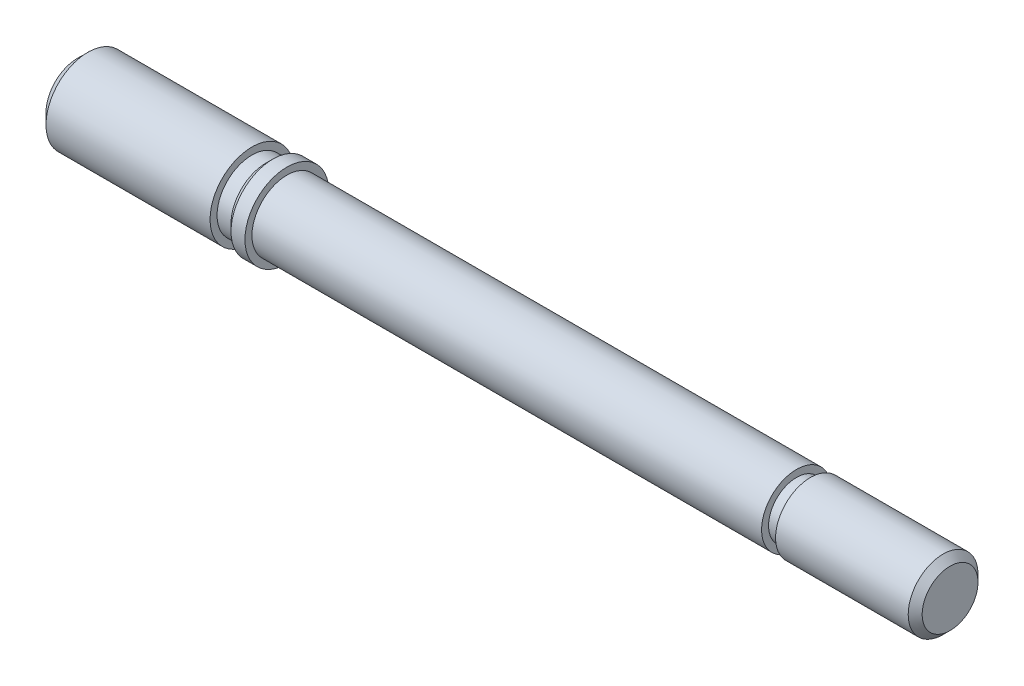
from build123d import *


with BuildPart() as part:
    # Esquisse1 → R_volution1 (revolve)
    with BuildSketch(Plane.XY, mode=Mode.PRIVATE) as r_volution1_sk:
        Polygon((0, 0), (0, 4.5), (1.5, 6), (25, 6), (25, 5), (27, 5), (28, 6), (30, 6), (30, 5), (103, 5), (103, 4), (105, 4), (105, 5), (124, 5), (125, 4), (125, 0), align=None)
    revolve(r_volution1_sk.sketch.rotate(Axis((-8.387740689, 0, 0), (1, 0, 0)), 90), axis=Axis((-8.387740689, 0, 0), (1, 0, 0)))


solid = part.part
